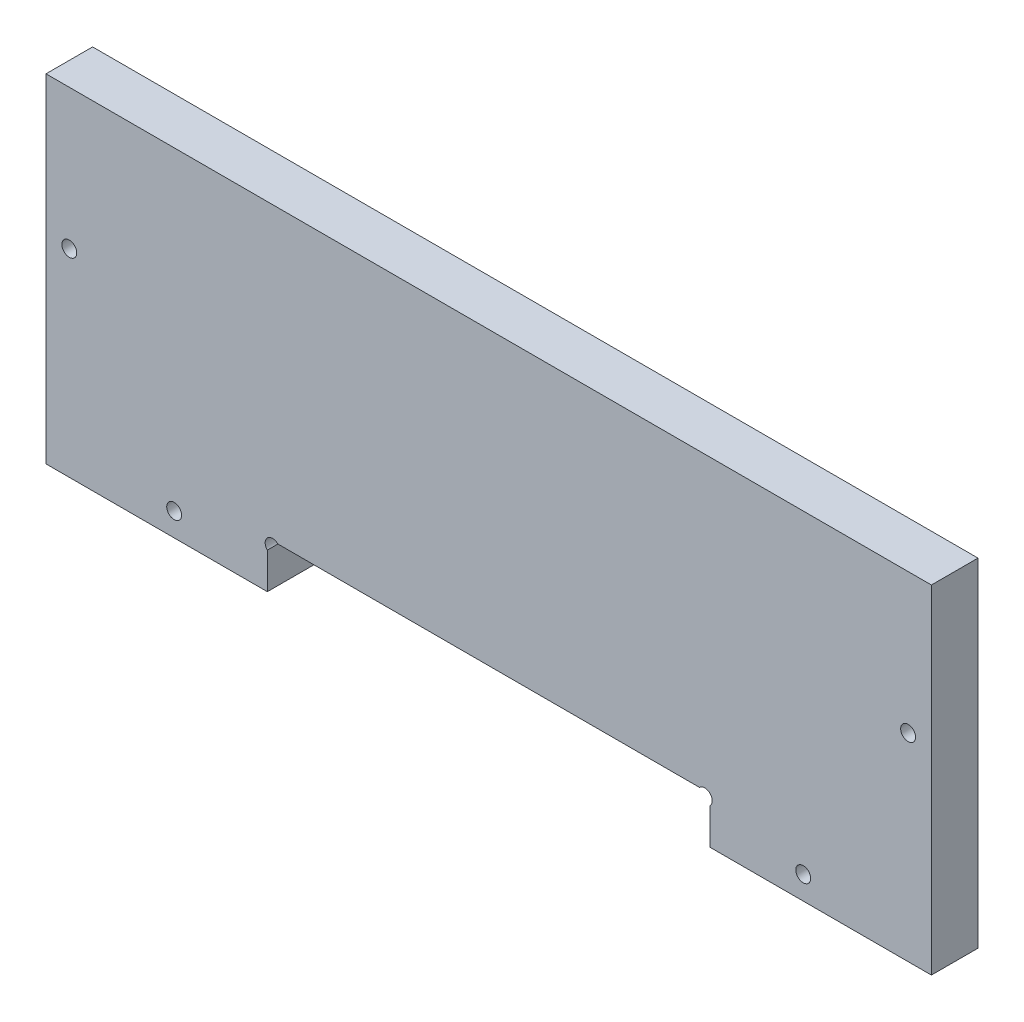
from build123d import *

# Parameters (mm, degrees)
ESQUISSE1_R             = 1.6
BOSS_EXTRU_1_DEPTH      = 10
ENL_V_MAT_EXTRU_1_DEPTH = 5


with BuildPart() as part:
    # Esquisse1 → Boss.-Extru.1 (new body)
    with BuildSketch(Plane.XY):
        with BuildLine():
            Line((-142.5, 7.7372583), (-142.5, 0))
            Line((-142.5, 0), (-190, 0))
            Line((-190, 0), (-190, 72.5))
            Line((-190, 72.5), (0, 72.5))
            Line((0, 72.5), (0, 0))
            Line((0, 0), (-47.5, 0))
            Line((-47.5, 0), (-47.5, 7.7372583))
            ThreePointArc((-47.5, 7.7372583), (-47.5, 10), (-49.7627417, 10))
            Line((-49.7627417, 10), (-140.2372583, 10))
            ThreePointArc((-140.2372583, 10), (-142.5, 10), (-142.5, 7.7372583))
        make_face()
        with Locations((-162.5, 5)):
            Circle(ESQUISSE1_R, mode=Mode.SUBTRACT)
        with Locations((-185, 42.5)):
            Circle(ESQUISSE1_R, mode=Mode.SUBTRACT)
        with Locations(Location((-5, 42.5, 0), (0, 0, 180))):
            Circle(ESQUISSE1_R, mode=Mode.SUBTRACT)
        with Locations(Location((-27.5, 5, 0), (0, 0, 180))):
            Circle(ESQUISSE1_R, mode=Mode.SUBTRACT)
    extrude(amount=BOSS_EXTRU_1_DEPTH)

    # Esquisse2 → Enl_v. mat.-Extru.1 (cut)
    with BuildSketch(Plane(origin=(0, 0, 0), x_dir=(-1, 0, 0), z_dir=(0, 0, -1))):
        with BuildLine():
            Line((98.2627417, 47), (103.7372583, 47))
            ThreePointArc((103.7372583, 47), (106, 47), (106, 44.7372583))
            Line((106, 44.7372583), (106, 10))
            Line((106, 10), (96, 10))
            Line((96, 10), (96, 44.7372583))
            ThreePointArc((96, 44.7372583), (96, 47), (98.2627417, 47))
        make_face()
    extrude(amount=-ENL_V_MAT_EXTRU_1_DEPTH, mode=Mode.SUBTRACT)


solid = part.part
